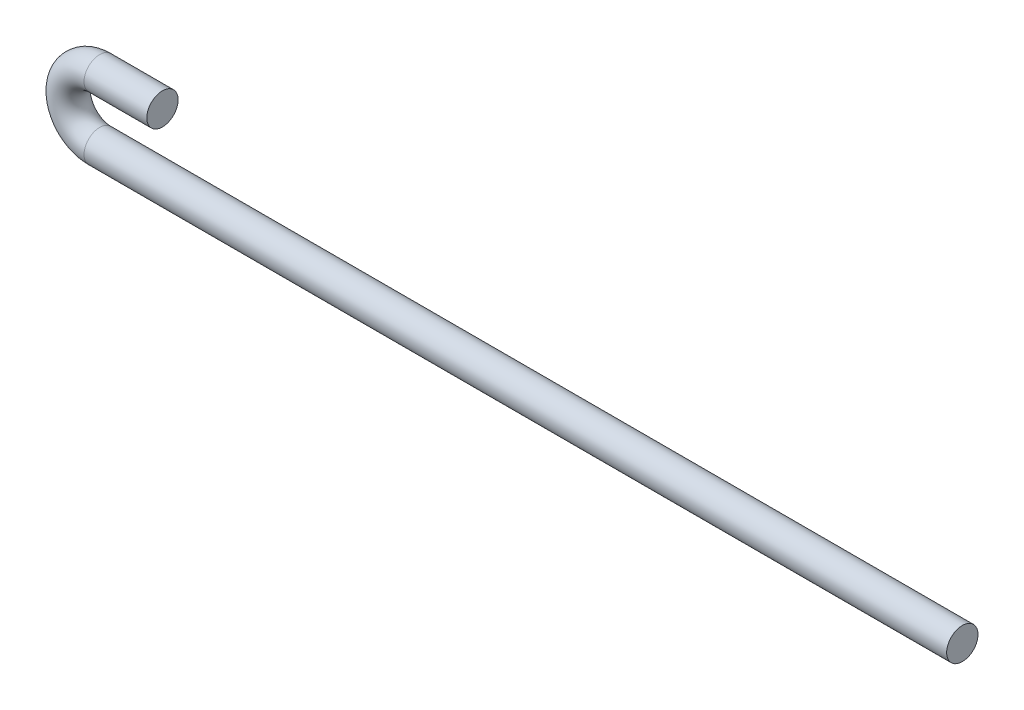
from build123d import *

# Parameters (mm, degrees)
SKETCH4_R = 0.79375


with BuildPart() as part:
    # Sweep1: sweep along a curve in space
    with BuildLine() as sweep1_path:
        Line((-4.687960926, 1.125158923, 0), (-48.344210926, 1.125158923, 0))
        ThreePointArc((-48.344210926, 1.125158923, 0), (-49.931710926, 2.712658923, 0), (-48.344210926, 4.300158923, 0))
        Line((-48.344210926, 4.300158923, 0), (-45.169210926, 4.300158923, 0))
    # Sketch4 → Sweep1 (sweep)
    with BuildSketch(Plane(origin=(-4.687960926, 1.125158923, 0), x_dir=(0, 0, 1), z_dir=(-1, 0, 0))):
        with Locations((0, -0.009288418)):
            Circle(SKETCH4_R)
    sweep(path=sweep1_path.line)


solid = part.part
